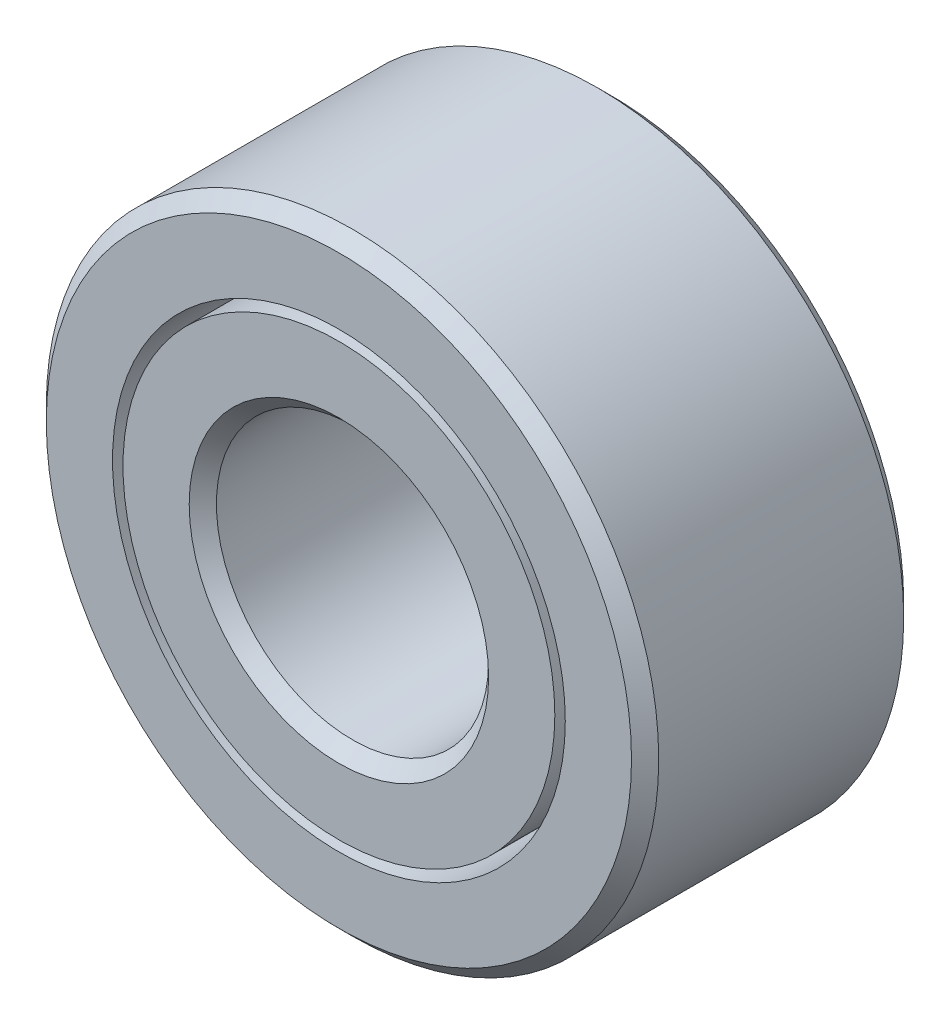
from build123d import *

# Parameters (mm, degrees)
CIRPATTERN1_COUNT = 16


with BuildPart() as part:
    # Sketch1 → Revolve1 (revolve)
    with BuildSketch(Plane(origin=(0, 0, 0), x_dir=(0, 0, -1), z_dir=(1, 0, 0)), mode=Mode.PRIVATE) as revolve1_sk:
        with BuildLine():
            Line((1.8, 4.5), (-1.8, 4.5))
            Line((-1.8, 4.5), (-2, 4.3))
            Line((-2, 4.3), (-2, 3.326923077))
            Line((-2, 3.326923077), (-0.494047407, 3.326923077))
            ThreePointArc((-0.494047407, 3.326923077), (0, 3.75), (0.494047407, 3.326923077))
            Line((0.494047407, 3.326923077), (2, 3.326923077))
            Line((2, 3.326923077), (2, 4.3))
            Line((2, 4.3), (1.8, 4.5))
        make_face()
    revolve(revolve1_sk.sketch.rotate(Axis((0, 0, 2), (0, 0, -1)), 90), axis=Axis((0, 0, 2), (0, 0, -1)))


with BuildPart() as body_2:
    # Sketch3 → Revolve3 (revolve)
    with BuildSketch(Plane(origin=(0, 0, 0), x_dir=(0, 0, -1), z_dir=(1, 0, 0)), mode=Mode.PRIVATE) as revolve3_sk:
        with BuildLine():
            Line((-2, 3.173076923), (-0.494047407, 3.173076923))
            ThreePointArc((-0.494047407, 3.173076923), (0, 2.75), (0.494047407, 3.173076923))
            Line((0.494047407, 3.173076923), (2, 3.173076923))
            Line((2, 3.173076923), (2, 2.2))
            Line((2, 2.2), (1.8, 2))
            Line((1.8, 2), (-1.8, 2))
            Line((-1.8, 2), (-2, 2.2))
            Line((-2, 2.2), (-2, 3.173076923))
        make_face()
    revolve(revolve3_sk.sketch.rotate(Axis((0, 0, 2), (0, 0, -1)), 90), axis=Axis((0, 0, 2), (0, 0, -1)))


with BuildPart() as body_3:
    # Sketch4 → Revolve4 (revolve)
    with BuildSketch(Plane(origin=(0, 0, 0), x_dir=(0, 0, -1), z_dir=(1, 0, 0))):
        with BuildLine():
            Line((-0.5, 3.25), (0.5, 3.25))
            ThreePointArc((0.5, 3.25), (0, 3.75), (-0.5, 3.25))
        make_face()
    revolve(axis=Axis((0, 3.25, 0.5), (0, 0, -1)))


with BuildPart() as cirpattern1_1:
    # CirPattern1: pattern copy
    add(body_3.part.rotate(Axis((0, 0, 0), (0, 0, 1)), 1 * 360 / CIRPATTERN1_COUNT))


with BuildPart() as cirpattern1_2:
    # CirPattern1: pattern copy
    add(body_3.part.rotate(Axis((0, 0, 0), (0, 0, 1)), 2 * 360 / CIRPATTERN1_COUNT))


with BuildPart() as cirpattern1_3:
    # CirPattern1: pattern copy
    add(body_3.part.rotate(Axis((0, 0, 0), (0, 0, 1)), 3 * 360 / CIRPATTERN1_COUNT))


with BuildPart() as cirpattern1_4:
    # CirPattern1: pattern copy
    add(body_3.part.rotate(Axis((0, 0, 0), (0, 0, 1)), 4 * 360 / CIRPATTERN1_COUNT))


with BuildPart() as cirpattern1_5:
    # CirPattern1: pattern copy
    add(body_3.part.rotate(Axis((0, 0, 0), (0, 0, 1)), 5 * 360 / CIRPATTERN1_COUNT))


with BuildPart() as cirpattern1_6:
    # CirPattern1: pattern copy
    add(body_3.part.rotate(Axis((0, 0, 0), (0, 0, 1)), 6 * 360 / CIRPATTERN1_COUNT))


with BuildPart() as cirpattern1_7:
    # CirPattern1: pattern copy
    add(body_3.part.rotate(Axis((0, 0, 0), (0, 0, 1)), 7 * 360 / CIRPATTERN1_COUNT))


with BuildPart() as cirpattern1_8:
    # CirPattern1: pattern copy
    add(body_3.part.rotate(Axis((0, 0, 0), (0, 0, 1)), 8 * 360 / CIRPATTERN1_COUNT))


with BuildPart() as cirpattern1_9:
    # CirPattern1: pattern copy
    add(body_3.part.rotate(Axis((0, 0, 0), (0, 0, 1)), 9 * 360 / CIRPATTERN1_COUNT))


with BuildPart() as cirpattern1_10:
    # CirPattern1: pattern copy
    add(body_3.part.rotate(Axis((0, 0, 0), (0, 0, 1)), 10 * 360 / CIRPATTERN1_COUNT))


with BuildPart() as cirpattern1_11:
    # CirPattern1: pattern copy
    add(body_3.part.rotate(Axis((0, 0, 0), (0, 0, 1)), 11 * 360 / CIRPATTERN1_COUNT))


with BuildPart() as cirpattern1_12:
    # CirPattern1: pattern copy
    add(body_3.part.rotate(Axis((0, 0, 0), (0, 0, 1)), 12 * 360 / CIRPATTERN1_COUNT))


with BuildPart() as cirpattern1_13:
    # CirPattern1: pattern copy
    add(body_3.part.rotate(Axis((0, 0, 0), (0, 0, 1)), 13 * 360 / CIRPATTERN1_COUNT))


with BuildPart() as cirpattern1_14:
    # CirPattern1: pattern copy
    add(body_3.part.rotate(Axis((0, 0, 0), (0, 0, 1)), 14 * 360 / CIRPATTERN1_COUNT))


with BuildPart() as cirpattern1_15:
    # CirPattern1: pattern copy
    add(body_3.part.rotate(Axis((0, 0, 0), (0, 0, 1)), 15 * 360 / CIRPATTERN1_COUNT))


solid = Compound([part.part, body_2.part, body_3.part, cirpattern1_1.part, cirpattern1_2.part, cirpattern1_3.part, cirpattern1_4.part, cirpattern1_5.part, cirpattern1_6.part, cirpattern1_7.part, cirpattern1_8.part, cirpattern1_9.part, cirpattern1_10.part, cirpattern1_11.part, cirpattern1_12.part, cirpattern1_13.part, cirpattern1_14.part, cirpattern1_15.part])
